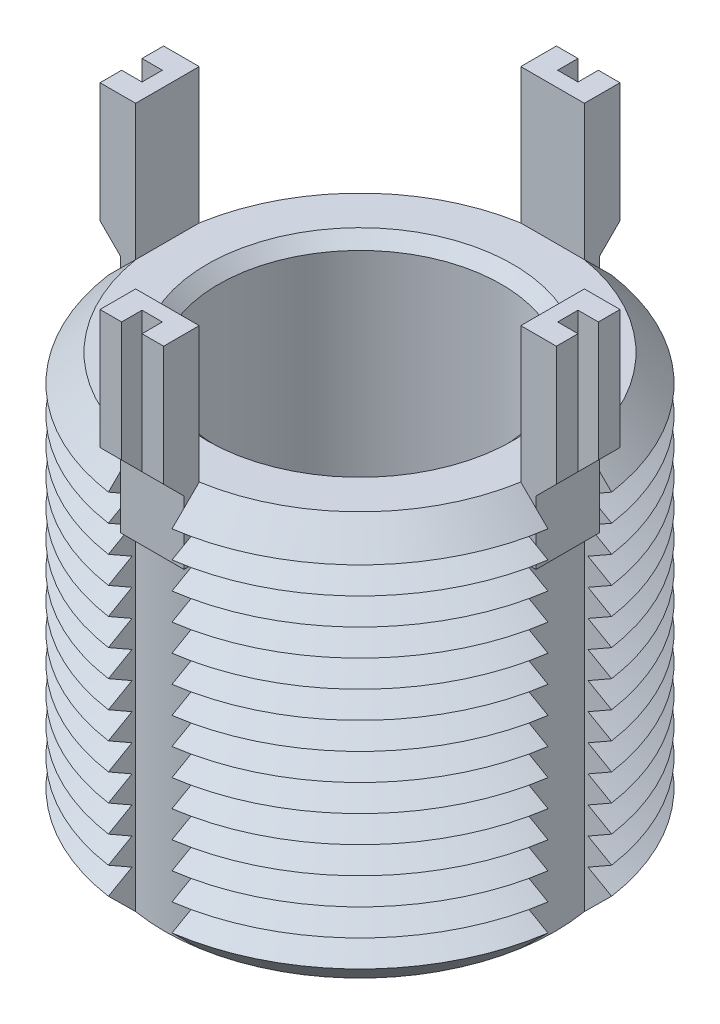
from build123d import *

# Parameters (mm, degrees)
SKETCH1_R               = 17.4625
BOSS_EXTRUDE1_DEPTH     = 31.75
CHAMFER1_SIZE           = 2.117
LPATTERN1_COUNT         = 13
LPATTERN1_PITCH         = 2.117
CUT_EXTRUDE1_REACH      = 42.224
CIRPATTERN1_COUNT       = 4
BOSS_EXTRUDE3_DEPTH     = 2.5
CIRPATTERN2_COUNT       = 4
CUT_EXTRUDE3_DEPTH      = 50.410499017
CUT_EXTRUDE3_DEPTH_BACK = 50.410499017
SKETCH6_W               = 1.6
SKETCH6_H               = 1.6
SKETCH7_R               = 11.1125
CUT_EXTRUDE4_DEPTH      = 31.75
CHAMFER2_SIZE           = 0.907


with BuildPart() as part:
    # Sketch1 → Boss-Extrude1 (new body)
    with BuildSketch(Plane(origin=(0, 0, 0), x_dir=(1, 0, 0), z_dir=(0, 1, 0))):
        with Locations(Location((0, 0, 0), (0, 0, 270))):
            Circle(SKETCH1_R)
    extrude(amount=-BOSS_EXTRUDE1_DEPTH)

    # Chamfer1
    chamfer1_edges = [part.edges().sort_by_distance(p)[0] for p in [
        (0, 0, -17.4625),
        (0, -31.75, -17.4625),
    ]]
    chamfer(chamfer1_edges, length=CHAMFER1_SIZE)

    # Sketch3 → Cut-Revolve1 (revolve, cut)
    with BuildSketch(Plane(origin=(0, 0, 0), x_dir=(0, 0, -1), z_dir=(1, 0, 0))):
        Polygon((-17.4625, -2.117), (-15.62912422, -3.1755), (-17.4625, -4.234), align=None)
    cut_revolve1 = revolve(axis=Axis((0, 0.885892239, 0), (0, -1, 0)), mode=Mode.SUBTRACT)

    # LPattern1: Cut-Revolve1 ×13
    with Locations(*[(0, -i * LPATTERN1_PITCH, 0) for i in range(1, LPATTERN1_COUNT)]):
        add(cut_revolve1, mode=Mode.SUBTRACT)

    # Cut-Extrude1: up to this cone (the profile starts inside it)
    cut_extrude1_end = Plane(origin=(0, 0, 0), z_dir=(0, 1, 0)).offset(-47.095499) * Cone(1e-06, 136.915, 136.914999, align=(Align.CENTER, Align.CENTER, Align.MIN), mode=Mode.PRIVATE)
    # Sketch4 → Cut-Extrude1 (cut, up to the surface)
    with BuildSketch(Plane(origin=(0, 0, 0), x_dir=(1, 0, 0), z_dir=(0, 1, 0)), mode=Mode.PRIVATE) as cut_extrude1_sk1:
        with BuildLine():
            Line((-15.140487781, 2.5), (-17.282618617, 2.5))
            ThreePointArc((-17.282618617, 2.5), (-17.4625, 0), (-17.282618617, -2.5))
            Line((-17.282618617, -2.5), (-15.140487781, -2.5))
            ThreePointArc((-15.140487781, -2.5), (-15.3455, 0), (-15.140487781, 2.5))
        make_face()
    cut_extrude1_tool1 = extrude(cut_extrude1_sk1.sketch, amount=-CUT_EXTRUDE1_REACH, mode=Mode.PRIVATE) & cut_extrude1_end
    cut_extrude1 = cut_extrude1_tool1.solids().sort_by_distance((-16.339803, 0, 0))[0]
    add(cut_extrude1, mode=Mode.SUBTRACT)

    # CirPattern1: Cut-Extrude1 ×4 about axis
    cirpattern1_axis = Axis((0, 0, 0), (0, 1, 0))
    for i in range(1, CIRPATTERN1_COUNT):
        add(cut_extrude1.rotate(cirpattern1_axis, i * 360 / CIRPATTERN1_COUNT), mode=Mode.SUBTRACT)

    # Sketch5 → Boss-Extrude3 (add, symmetric)
    with BuildSketch(Plane(origin=(0, 0, 0), x_dir=(0, 0, -1), z_dir=(1, 0, 0))):
        Polygon((-15.140487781, 10.649), (-15.140487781, -5.351), (-16.340487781, -5.351), (-16.340487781, -0.351), (-17.940487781, 1.249), (-17.940487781, 10.649), align=None)
    boss_extrude3 = extrude(amount=BOSS_EXTRUDE3_DEPTH, both=True)

    # CirPattern2: Boss-Extrude3 ×4 about axis
    cirpattern2_axis = Axis((0, 0, 0), (0, 1, 0))
    for i in range(1, CIRPATTERN2_COUNT):
        add(boss_extrude3.rotate(cirpattern2_axis, i * 360 / CIRPATTERN2_COUNT))

    # Sketch6 → Cut-Extrude3 (cut, two sides: drawn at the far end of the back side and taken through both)
    with BuildSketch(Plane(origin=(0, 10.649, 0), x_dir=(1, 0, 0), z_dir=(0, 1, 0)).offset(-CUT_EXTRUDE3_DEPTH_BACK)):
        with Locations((-17.140487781, 0)):
            Rectangle(SKETCH6_W, SKETCH6_H)
        with Locations((0, 17.140487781)):
            Rectangle(SKETCH6_W, SKETCH6_H)
        with Locations((17.140487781, 0)):
            Rectangle(SKETCH6_W, SKETCH6_H)
        with Locations((0, -17.140487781)):
            Rectangle(SKETCH6_W, SKETCH6_H)
    extrude(amount=CUT_EXTRUDE3_DEPTH + CUT_EXTRUDE3_DEPTH_BACK, mode=Mode.SUBTRACT)

    # Sketch7 → Cut-Extrude4 (cut)
    with BuildSketch(Plane(origin=(0, 0, 0), x_dir=(1, 0, 0), z_dir=(0, 1, 0))):
        with Locations(Location((0, 0, 0), (0, 0, 270))):
            Circle(SKETCH7_R)
    extrude(amount=-CUT_EXTRUDE4_DEPTH, mode=Mode.SUBTRACT)

    # Chamfer2
    chamfer2_edges = [part.edges().sort_by_distance(p)[0] for p in [
        (0, 0, -11.1125),
        (0, -31.75, -11.1125),
    ]]
    chamfer(chamfer2_edges, length=CHAMFER2_SIZE)


solid = part.part
